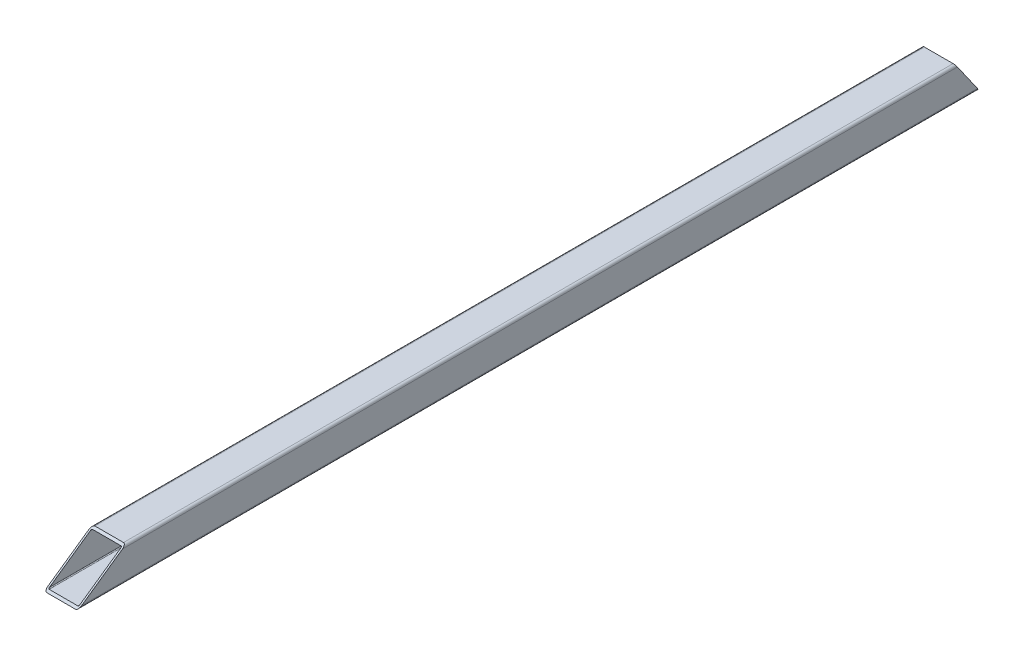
from build123d import *

# Parameters (mm, degrees)
BASE_EXTRUSION_DEPTH    = 1070
ENL_V_MAT_EXTRU_1_DEPTH = 1072.494283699
ENL_V_MAT_EXTRU_2_DEPTH = 1072.494283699


with BuildPart() as part:
    # Esquisse1 → Base-Extrusion (new body)
    with BuildSketch(Plane.XY):
        with BuildLine():
            Line((3, 0), (37, 0))
            ThreePointArc((37, 0), (39.121320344, -0.878679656), (40, -3))
            Line((40, -3), (40, -37))
            ThreePointArc((40, -37), (39.121320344, -39.121320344), (37, -40))
            Line((37, -40), (3, -40))
            ThreePointArc((3, -40), (0.878679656, -39.121320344), (0, -37))
            Line((0, -37), (0, -3))
            ThreePointArc((0, -3), (0.878679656, -0.878679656), (3, 0))
        make_face()
        with BuildLine():
            Line((2, -3), (2, -37))
            ThreePointArc((2, -37), (2.292893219, -37.707106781), (3, -38))
            Line((3, -38), (37, -38))
            ThreePointArc((37, -38), (37.707106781, -37.707106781), (38, -37))
            Line((38, -37), (38, -3))
            ThreePointArc((38, -3), (37.707106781, -2.292893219), (37, -2))
            Line((37, -2), (3, -2))
            ThreePointArc((3, -2), (2.292893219, -2.292893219), (2, -3))
        make_face(mode=Mode.SUBTRACT)
    extrude(amount=BASE_EXTRUSION_DEPTH)

    # Esquisse2 → Enl_v. mat.-Extru.1 (cut, through all)
    with BuildSketch(Plane.ZY):
        Polygon((0, 0), (0, -40), (28.008301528, 0), align=None)
    extrude(amount=-ENL_V_MAT_EXTRU_1_DEPTH, mode=Mode.SUBTRACT)

    # Esquisse3 → Enl_v. mat.-Extru.2 (cut, through all)
    with BuildSketch(Plane.ZY):
        Polygon((1012.87407973, 0), (1070, -40), (1070, 0), align=None)
    extrude(amount=-ENL_V_MAT_EXTRU_2_DEPTH, mode=Mode.SUBTRACT)


solid = part.part
